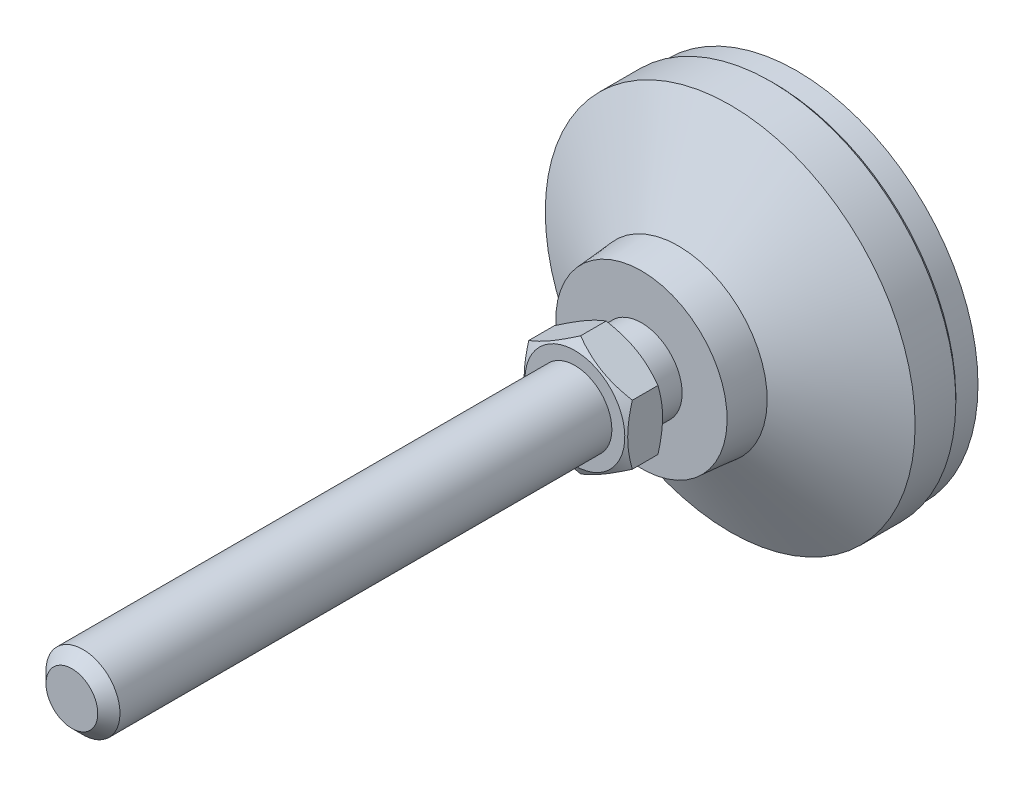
ISO-10303-21;
HEADER;
FILE_DESCRIPTION(('STEP AP214'),'2;1');
FILE_NAME('part.step','',(''),(''),'','','');
FILE_SCHEMA(('AUTOMOTIVE_DESIGN { 1 0 10303 214 1 1 1 1 }'));
ENDSEC;
DATA;
#1=APPLICATION_CONTEXT('core data for automotive mechanical design processes');
#2=APPLICATION_PROTOCOL_DEFINITION('international standard','automotive_design',2000,#1);
#3=PRODUCT_CONTEXT('',#1,'mechanical');
#4=PRODUCT('Part','Part','',(#3));
#5=PRODUCT_RELATED_PRODUCT_CATEGORY('part','',(#4));
#6=PRODUCT_DEFINITION_FORMATION('','',#4);
#7=PRODUCT_DEFINITION_CONTEXT('part definition',#1,'design');
#8=PRODUCT_DEFINITION('design','',#6,#7);
#9=PRODUCT_DEFINITION_SHAPE('','',#8);
#10=(LENGTH_UNIT() NAMED_UNIT(*) SI_UNIT(.MILLI.,.METRE.));
#11=(NAMED_UNIT(*) PLANE_ANGLE_UNIT() SI_UNIT($,.RADIAN.));
#12=(NAMED_UNIT(*) SI_UNIT($,.STERADIAN.) SOLID_ANGLE_UNIT());
#13=UNCERTAINTY_MEASURE_WITH_UNIT(LENGTH_MEASURE(1.E-05),#10,'distance_accuracy_value','');
#14=(GEOMETRIC_REPRESENTATION_CONTEXT(3) GLOBAL_UNCERTAINTY_ASSIGNED_CONTEXT((#13)) GLOBAL_UNIT_ASSIGNED_CONTEXT((#10,
#11,#12)) REPRESENTATION_CONTEXT('',''));
#15=CARTESIAN_POINT('',(0.,0.,0.));
#16=DIRECTION('',(0.,0.,1.));
#17=DIRECTION('',(1.,0.,0.));
#18=AXIS2_PLACEMENT_3D('',#15,#16,#17);
#19=CARTESIAN_POINT('',(0.,0.,2.));
#20=DIRECTION('',(0.,0.,-1.));
#21=DIRECTION('',(0.,1.,0.));
#22=AXIS2_PLACEMENT_3D('',#19,#20,#21);
#23=CYLINDRICAL_SURFACE('',#22,5.50000000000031);
#24=CARTESIAN_POINT('',(0.,0.,25.));
#25=DIRECTION('',(0.,0.,-1.));
#26=DIRECTION('',(0.,1.,0.));
#27=AXIS2_PLACEMENT_3D('',#24,#25,#26);
#28=CIRCLE('',#27,5.50000000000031);
#29=CARTESIAN_POINT('',(0.,5.50000000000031,25.));
#30=VERTEX_POINT('',#29);
#31=EDGE_CURVE('E100',#30,#30,#28,.T.);
#32=ORIENTED_EDGE('',*,*,#31,.T.);
#33=EDGE_LOOP('',(#32));
#34=FACE_BOUND('',#33,.T.);
#35=CARTESIAN_POINT('',(0.,0.,21.));
#36=DIRECTION('',(0.,0.,-1.));
#37=DIRECTION('',(0.,1.,0.));
#38=AXIS2_PLACEMENT_3D('',#35,#36,#37);
#39=CIRCLE('',#38,5.50000000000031);
#40=CARTESIAN_POINT('',(0.,5.50000000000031,21.));
#41=VERTEX_POINT('',#40);
#42=EDGE_CURVE('E93',#41,#41,#39,.T.);
#43=ORIENTED_EDGE('',*,*,#42,.F.);
#44=EDGE_LOOP('',(#43));
#45=FACE_BOUND('',#44,.T.);
#46=ADVANCED_FACE('F14',(#34,#45),#23,.T.);
#47=CARTESIAN_POINT('',(-5.50000000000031,0.,25.));
#48=DIRECTION('',(0.,0.,1.));
#49=DIRECTION('',(0.,-1.,0.));
#50=AXIS2_PLACEMENT_3D('',#47,#48,#49);
#51=PLANE('',#50);
#52=CARTESIAN_POINT('',(0.,0.,25.));
#53=DIRECTION('',(0.,0.,1.));
#54=DIRECTION('',(0.,-1.,0.));
#55=AXIS2_PLACEMENT_3D('',#52,#53,#54);
#56=CIRCLE('',#55,6.75);
#57=CARTESIAN_POINT('',(0.,-6.75,25.));
#58=VERTEX_POINT('',#57);
#59=EDGE_CURVE('E284',#58,#58,#56,.T.);
#60=ORIENTED_EDGE('',*,*,#59,.F.);
#61=EDGE_LOOP('',(#60));
#62=FACE_BOUND('',#61,.T.);
#63=ORIENTED_EDGE('',*,*,#31,.F.);
#64=EDGE_LOOP('',(#63));
#65=FACE_BOUND('',#64,.T.);
#66=ADVANCED_FACE('F142',(#62,#65),#51,.F.);
#67=CARTESIAN_POINT('',(0.,5.50000000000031,21.));
#68=DIRECTION('',(0.,0.,-1.));
#69=DIRECTION('',(0.,1.,0.));
#70=AXIS2_PLACEMENT_3D('',#67,#68,#69);
#71=PLANE('',#70);
#72=ORIENTED_EDGE('',*,*,#42,.T.);
#73=EDGE_LOOP('',(#72));
#74=FACE_BOUND('',#73,.T.);
#75=CARTESIAN_POINT('',(0.,0.,21.));
#76=DIRECTION('',(0.,0.,-1.));
#77=DIRECTION('',(0.,1.,0.));
#78=AXIS2_PLACEMENT_3D('',#75,#76,#77);
#79=CIRCLE('',#78,11.5833333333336);
#80=CARTESIAN_POINT('',(0.,11.5833333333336,21.));
#81=VERTEX_POINT('',#80);
#82=EDGE_CURVE('E88',#81,#81,#79,.T.);
#83=ORIENTED_EDGE('',*,*,#82,.F.);
#84=EDGE_LOOP('',(#83));
#85=FACE_BOUND('',#84,.T.);
#86=ADVANCED_FACE('F125',(#74,#85),#71,.F.);
#87=CARTESIAN_POINT('',(0.,0.,2.));
#88=DIRECTION('',(0.,0.,-1.));
#89=DIRECTION('',(0.,1.,0.));
#90=AXIS2_PLACEMENT_3D('',#87,#88,#89);
#91=CYLINDRICAL_SURFACE('',#90,25.);
#92=CARTESIAN_POINT('',(0.,0.,3.5));
#93=DIRECTION('',(0.,0.,1.));
#94=DIRECTION('',(0.,-1.,0.));
#95=AXIS2_PLACEMENT_3D('',#92,#93,#94);
#96=CIRCLE('',#95,25.);
#97=CARTESIAN_POINT('',(0.,-25.,3.5));
#98=VERTEX_POINT('',#97);
#99=EDGE_CURVE('E108',#98,#98,#96,.T.);
#100=ORIENTED_EDGE('',*,*,#99,.T.);
#101=EDGE_LOOP('',(#100));
#102=FACE_BOUND('',#101,.T.);
#103=CARTESIAN_POINT('',(0.,0.,9.));
#104=DIRECTION('',(0.,0.,-1.));
#105=DIRECTION('',(0.,1.,0.));
#106=AXIS2_PLACEMENT_3D('',#103,#104,#105);
#107=CIRCLE('',#106,25.);
#108=CARTESIAN_POINT('',(0.,25.,9.));
#109=VERTEX_POINT('',#108);
#110=EDGE_CURVE('E106',#109,#109,#107,.T.);
#111=ORIENTED_EDGE('',*,*,#110,.T.);
#112=EDGE_LOOP('',(#111));
#113=FACE_BOUND('',#112,.T.);
#114=ADVANCED_FACE('F121',(#102,#113),#91,.T.);
#115=CARTESIAN_POINT('',(0.,0.,16.));
#116=DIRECTION('',(0.,0.,-1.));
#117=DIRECTION('',(0.,1.,0.));
#118=AXIS2_PLACEMENT_3D('',#115,#116,#117);
#119=CONICAL_SURFACE('',#118,12.0000000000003,1.07685495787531);
#120=ORIENTED_EDGE('',*,*,#110,.F.);
#121=EDGE_LOOP('',(#120));
#122=FACE_BOUND('',#121,.T.);
#123=CARTESIAN_POINT('',(0.,0.,16.));
#124=DIRECTION('',(0.,0.,-1.));
#125=DIRECTION('',(0.,1.,0.));
#126=AXIS2_PLACEMENT_3D('',#123,#124,#125);
#127=CIRCLE('',#126,12.0000000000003);
#128=CARTESIAN_POINT('',(0.,12.0000000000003,16.));
#129=VERTEX_POINT('',#128);
#130=EDGE_CURVE('E103',#129,#129,#127,.T.);
#131=ORIENTED_EDGE('',*,*,#130,.T.);
#132=EDGE_LOOP('',(#131));
#133=FACE_BOUND('',#132,.T.);
#134=ADVANCED_FACE('F124',(#122,#133),#119,.T.);
#135=CARTESIAN_POINT('',(0.,0.,22.));
#136=DIRECTION('',(0.,0.,-1.));
#137=DIRECTION('',(0.,1.,0.));
#138=AXIS2_PLACEMENT_3D('',#135,#136,#137);
#139=CONICAL_SURFACE('',#138,11.5000000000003,0.0831412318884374);
#140=ORIENTED_EDGE('',*,*,#82,.T.);
#141=EDGE_LOOP('',(#140));
#142=FACE_BOUND('',#141,.T.);
#143=ORIENTED_EDGE('',*,*,#130,.F.);
#144=EDGE_LOOP('',(#143));
#145=FACE_BOUND('',#144,.T.);
#146=ADVANCED_FACE('F118',(#142,#145),#139,.T.);
#147=CARTESIAN_POINT('',(0.,0.,3.5));
#148=DIRECTION('',(0.,0.,1.));
#149=DIRECTION('',(0.,-1.,0.));
#150=AXIS2_PLACEMENT_3D('',#147,#148,#149);
#151=CONICAL_SURFACE('',#150,25.,0.785398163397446);
#152=CARTESIAN_POINT('',(0.,0.,3.));
#153=DIRECTION('',(0.,0.,1.));
#154=DIRECTION('',(0.,-1.,0.));
#155=AXIS2_PLACEMENT_3D('',#152,#153,#154);
#156=CIRCLE('',#155,24.5);
#157=CARTESIAN_POINT('',(0.,-24.5,3.));
#158=VERTEX_POINT('',#157);
#159=EDGE_CURVE('E28',#158,#158,#156,.F.);
#160=ORIENTED_EDGE('',*,*,#159,.F.);
#161=EDGE_LOOP('',(#160));
#162=FACE_BOUND('',#161,.T.);
#163=ORIENTED_EDGE('',*,*,#99,.F.);
#164=EDGE_LOOP('',(#163));
#165=FACE_BOUND('',#164,.T.);
#166=ADVANCED_FACE('F16',(#162,#165),#151,.T.);
#167=CARTESIAN_POINT('',(0.,0.,0.));
#168=DIRECTION('',(0.,0.,1.));
#169=DIRECTION('',(0.,-1.,0.));
#170=AXIS2_PLACEMENT_3D('',#167,#168,#169);
#171=CYLINDRICAL_SURFACE('',#170,24.5);
#172=CARTESIAN_POINT('',(0.,0.,0.));
#173=DIRECTION('',(0.,0.,-1.));
#174=DIRECTION('',(0.,1.,0.));
#175=AXIS2_PLACEMENT_3D('',#172,#173,#174);
#176=CIRCLE('',#175,24.5);
#177=CARTESIAN_POINT('',(0.,24.5,0.));
#178=VERTEX_POINT('',#177);
#179=EDGE_CURVE('E251',#178,#178,#176,.T.);
#180=ORIENTED_EDGE('',*,*,#179,.F.);
#181=EDGE_LOOP('',(#180));
#182=FACE_BOUND('',#181,.T.);
#183=ORIENTED_EDGE('',*,*,#159,.T.);
#184=EDGE_LOOP('',(#183));
#185=FACE_BOUND('',#184,.T.);
#186=ADVANCED_FACE('F114',(#182,#185),#171,.T.);
#187=CARTESIAN_POINT('',(0.,0.,0.));
#188=DIRECTION('',(0.,0.,-1.));
#189=DIRECTION('',(0.,1.,0.));
#190=AXIS2_PLACEMENT_3D('',#187,#188,#189);
#191=PLANE('',#190);
#192=ORIENTED_EDGE('',*,*,#179,.T.);
#193=EDGE_LOOP('',(#192));
#194=FACE_BOUND('',#193,.T.);
#195=ADVANCED_FACE('F193',(#194),#191,.T.);
#196=CARTESIAN_POINT('',(0.,0.,25.));
#197=DIRECTION('',(0.,0.,1.));
#198=DIRECTION('',(0.,-1.,0.));
#199=AXIS2_PLACEMENT_3D('',#196,#197,#198);
#200=CONICAL_SURFACE('',#199,6.75,1.0471975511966);
#201=CARTESIAN_POINT('',(0.000200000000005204,-8.08301923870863,25.7696190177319));
#202=CARTESIAN_POINT('',(-0.15366790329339,-7.99418356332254,25.7183374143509));
#203=CARTESIAN_POINT('',(-0.30810950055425,-7.90501666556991,25.669383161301));
#204=CARTESIAN_POINT('',(-0.618246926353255,-7.72595873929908,25.5767703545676));
#205=CARTESIAN_POINT('',(-0.773943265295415,-7.63606741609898,25.5331140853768));
#206=CARTESIAN_POINT('',(-1.24352516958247,-7.36495417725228,25.4109491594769));
#207=CARTESIAN_POINT('',(-1.5592643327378,-7.18266208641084,25.3414631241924));
#208=CARTESIAN_POINT('',(-2.03176224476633,-6.90986528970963,25.2599825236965));
#209=CARTESIAN_POINT('',(-2.18710922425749,-6.82017566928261,25.2367710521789));
#210=CARTESIAN_POINT('',(-2.49850511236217,-6.64039116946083,25.1978487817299));
#211=CARTESIAN_POINT('',(-2.65455395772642,-6.55029632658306,25.1821373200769));
#212=CARTESIAN_POINT('',(-2.96692267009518,-6.36995016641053,25.1586154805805));
#213=CARTESIAN_POINT('',(-3.12324202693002,-6.27969914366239,25.1507961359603));
#214=CARTESIAN_POINT('',(-3.43601650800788,-6.09911871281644,25.1432178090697));
#215=CARTESIAN_POINT('',(-3.59247162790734,-6.00878930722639,25.1434585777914));
#216=CARTESIAN_POINT('',(-4.02110687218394,-5.76131663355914,25.155197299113));
#217=CARTESIAN_POINT('',(-4.2931466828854,-5.60425437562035,25.1749033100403));
#218=CARTESIAN_POINT('',(-4.8354194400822,-5.29117305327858,25.2373910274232));
#219=CARTESIAN_POINT('',(-5.10565047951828,-5.13515508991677,25.2801940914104));
#220=CARTESIAN_POINT('',(-5.64901454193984,-4.82144370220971,25.3871892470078));
#221=CARTESIAN_POINT('',(-5.92207900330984,-4.66378986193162,25.4518346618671));
#222=CARTESIAN_POINT('',(-6.46413578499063,-4.35083323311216,25.5985536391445));
#223=CARTESIAN_POINT('',(-6.73313504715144,-4.1955264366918,25.680592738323));
#224=CARTESIAN_POINT('',(-7.0002,-4.04133641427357,25.7696190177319));
#225=B_SPLINE_CURVE_WITH_KNOTS('',3,(#201,#202,#203,#204,#205,#206,#207,#208,#209,#210,#211,
#212,#213,#214,#215,#216,#217,#218,#219,#220,#221,#222,#223,#224),.UNSPECIFIED.,.F.,.F.,(4,2,2,
2,2,2,2,2,2,2,2,4),(0.,0.554727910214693,1.10969417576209,2.2219327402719,2.76443041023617,
3.30688013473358,3.84871284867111,4.3905288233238,5.33376515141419,6.27787517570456,
7.2429241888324,8.20607866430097),.UNSPECIFIED.);
#226=CARTESIAN_POINT('',(0.,-8.08290376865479,25.7695523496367));
#227=VERTEX_POINT('',#226);
#228=CARTESIAN_POINT('',(-7.,-4.04145188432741,25.7695523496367));
#229=VERTEX_POINT('',#228);
#230=EDGE_CURVE('E73',#227,#229,#225,.T.);
#231=ORIENTED_EDGE('',*,*,#230,.T.);
#232=CARTESIAN_POINT('',(-7.,10.8837636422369,28.5740817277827));
#233=CARTESIAN_POINT('',(-7.,10.5777915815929,28.4255457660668));
#234=CARTESIAN_POINT('',(-7.,10.2711201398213,28.2784259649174));
#235=CARTESIAN_POINT('',(-7.,9.65600665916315,27.9878146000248));
#236=CARTESIAN_POINT('',(-7.,9.34756435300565,27.8443236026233));
#237=CARTESIAN_POINT('',(-7.,8.72696150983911,27.5610498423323));
#238=CARTESIAN_POINT('',(-7.,8.41478988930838,27.4212912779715));
#239=CARTESIAN_POINT('',(-7.,7.78797355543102,27.1474563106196));
#240=CARTESIAN_POINT('',(-7.,7.47332895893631,27.0133796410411));
#241=CARTESIAN_POINT('',(-7.,6.83080388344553,26.7481718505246));
#242=CARTESIAN_POINT('',(-7.,6.50282517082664,26.6172774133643));
#243=CARTESIAN_POINT('',(-7.,5.84304174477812,26.3653275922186));
#244=CARTESIAN_POINT('',(-7.,5.51123660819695,26.2442733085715));
#245=CARTESIAN_POINT('',(-7.,4.8438804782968,26.0151615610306));
#246=CARTESIAN_POINT('',(-7.,4.50833853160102,25.9070780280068));
#247=CARTESIAN_POINT('',(-7.,3.83245340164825,25.7073561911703));
#248=CARTESIAN_POINT('',(-7.,3.49211175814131,25.6157127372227));
#249=CARTESIAN_POINT('',(-7.,2.80827179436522,25.4537453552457));
#250=CARTESIAN_POINT('',(-7.,2.46480185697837,25.3833048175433));
#251=CARTESIAN_POINT('',(-7.,1.94644652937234,25.2965814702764));
#252=CARTESIAN_POINT('',(-7.,1.77312364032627,25.2708287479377));
#253=CARTESIAN_POINT('',(-7.,1.42560767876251,25.2261404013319));
#254=CARTESIAN_POINT('',(-7.,1.25141469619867,25.2072040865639));
#255=CARTESIAN_POINT('',(-7.,0.904678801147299,25.1767645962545));
#256=CARTESIAN_POINT('',(-7.,0.732144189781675,25.1651672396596));
#257=CARTESIAN_POINT('',(-7.,0.386739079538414,25.1492805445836));
#258=CARTESIAN_POINT('',(-7.,0.213868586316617,25.144991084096));
#259=CARTESIAN_POINT('',(-7.,-0.131899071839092,25.1438225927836));
#260=CARTESIAN_POINT('',(-7.,-0.304796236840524,25.1469435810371));
#261=CARTESIAN_POINT('',(-7.,-0.650304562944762,25.1605193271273));
#262=CARTESIAN_POINT('',(-7.,-0.822915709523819,25.1709744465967));
#263=CARTESIAN_POINT('',(-7.,-1.23690300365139,25.2046230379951));
#264=CARTESIAN_POINT('',(-7.,-1.47800611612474,25.2312490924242));
#265=CARTESIAN_POINT('',(-7.,-1.9584299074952,25.2973641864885));
#266=CARTESIAN_POINT('',(-7.,-2.19775034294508,25.3368549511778));
#267=CARTESIAN_POINT('',(-7.,-2.91275984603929,25.4725309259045));
#268=CARTESIAN_POINT('',(-7.,-3.38523259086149,25.5858954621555));
#269=CARTESIAN_POINT('',(-7.,-4.0917486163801,25.782576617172));
#270=CARTESIAN_POINT('',(-7.,-4.32945384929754,25.8534962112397));
#271=CARTESIAN_POINT('',(-7.,-4.80255577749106,26.0027259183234));
#272=CARTESIAN_POINT('',(-7.,-5.03795245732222,26.0810360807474));
#273=CARTESIAN_POINT('',(-7.,-5.5065109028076,26.2437883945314));
#274=CARTESIAN_POINT('',(-7.,-5.7396733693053,26.3282285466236));
#275=CARTESIAN_POINT('',(-7.,-6.20406472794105,26.5022448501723));
#276=CARTESIAN_POINT('',(-7.,-6.43529364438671,26.5918209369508));
#277=CARTESIAN_POINT('',(-7.,-6.98752912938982,26.8116843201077));
#278=CARTESIAN_POINT('',(-7.,-7.30772186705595,26.9440121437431));
#279=CARTESIAN_POINT('',(-7.,-7.94532947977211,27.2152186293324));
#280=CARTESIAN_POINT('',(-7.,-8.26274417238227,27.3540977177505));
#281=CARTESIAN_POINT('',(-7.,-8.89532383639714,27.6370728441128));
#282=CARTESIAN_POINT('',(-7.,-9.21048825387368,27.781170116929));
#283=CARTESIAN_POINT('',(-7.,-9.83887440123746,28.0735110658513));
#284=CARTESIAN_POINT('',(-7.,-10.1520961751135,28.2217546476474));
#285=CARTESIAN_POINT('',(-7.,-10.7772822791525,28.5217708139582));
#286=CARTESIAN_POINT('',(-7.,-11.0892447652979,28.6735472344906));
#287=CARTESIAN_POINT('',(-7.,-11.7118136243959,28.9798589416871));
#288=CARTESIAN_POINT('',(-7.,-12.0224199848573,29.1343942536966));
#289=CARTESIAN_POINT('',(-7.,-12.9524461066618,29.60135042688));
#290=CARTESIAN_POINT('',(-7.,-13.5701618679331,29.9171645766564));
#291=CARTESIAN_POINT('',(-7.,-14.7493863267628,30.5277239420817));
#292=CARTESIAN_POINT('',(-7.,-15.3111656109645,30.8219489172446));
#293=CARTESIAN_POINT('',(-7.,-16.4326469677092,31.4143794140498));
#294=CARTESIAN_POINT('',(-7.,-16.9923489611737,31.7125850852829));
#295=CARTESIAN_POINT('',(-7.,-18.1086887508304,32.3112433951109));
#296=CARTESIAN_POINT('',(-7.,-18.6653307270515,32.6116882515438));
#297=CARTESIAN_POINT('',(-7.,-19.7772906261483,33.2149435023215));
#298=CARTESIAN_POINT('',(-7.,-20.3326086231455,33.5177537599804));
#299=CARTESIAN_POINT('',(-7.,-20.8874414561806,33.8214444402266));
#300=B_SPLINE_CURVE_WITH_KNOTS('',3,(#232,#233,#234,#235,#236,#237,#238,#239,#240,#241,#242,
#243,#244,#245,#246,#247,#248,#249,#250,#251,#252,#253,#254,#255,#256,#257,#258,#259,#260,#261,
#262,#263,#264,#265,#266,#267,#268,#269,#270,#271,#272,#273,#274,#275,#276,#277,#278,#279,#280,
#281,#282,#283,#284,#285,#286,#287,#288,#289,#290,#291,#292,#293,#294,#295,#296,#297,#298,#299),
.UNSPECIFIED.,.F.,.F.,(4,2,2,2,2,2,2,2,2,2,2,2,2,2,2,2,2,2,2,2,2,2,2,2,2,2,2,2,2,2,2,2,2,4),(0.,
1.02037328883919,2.04090485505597,3.0669453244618,4.09293759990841,5.15221607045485,
6.21161282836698,7.26884338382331,8.32574216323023,9.37671739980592,9.90228140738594,
10.427792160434,10.9464144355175,11.4650280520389,11.9836430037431,12.5022835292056,
13.2295797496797,13.9569735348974,15.412554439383,16.1566694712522,16.900789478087,
17.6446678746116,18.3885369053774,19.4278154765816,20.4671617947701,21.5067557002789,
22.5463259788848,23.5870831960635,24.6278499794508,26.7090870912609,28.6115629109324,
30.5141104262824,32.4117493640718,34.3092794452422),.UNSPECIFIED.);
#301=CARTESIAN_POINT('',(-7.,4.04145188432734,25.7695523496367));
#302=VERTEX_POINT('',#301);
#303=EDGE_CURVE('E81',#229,#302,#300,.F.);
#304=ORIENTED_EDGE('',*,*,#303,.T.);
#305=CARTESIAN_POINT('',(-7.0002,4.0413364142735,25.7696190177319));
#306=CARTESIAN_POINT('',(-6.84633209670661,4.13017208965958,25.7183374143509));
#307=CARTESIAN_POINT('',(-6.69189049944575,4.21933898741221,25.669383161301));
#308=CARTESIAN_POINT('',(-6.38175307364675,4.39839691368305,25.5767703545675));
#309=CARTESIAN_POINT('',(-6.22605673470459,4.48828823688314,25.5331140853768));
#310=CARTESIAN_POINT('',(-5.75647483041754,4.75940147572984,25.4109491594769));
#311=CARTESIAN_POINT('',(-5.44073566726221,4.94169356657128,25.3414631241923));
#312=CARTESIAN_POINT('',(-4.96823775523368,5.21449036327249,25.2599825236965));
#313=CARTESIAN_POINT('',(-4.81289077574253,5.3041799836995,25.2367710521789));
#314=CARTESIAN_POINT('',(-4.50149488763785,5.48396448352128,25.1978487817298));
#315=CARTESIAN_POINT('',(-4.34544604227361,5.57405932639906,25.1821373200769));
#316=CARTESIAN_POINT('',(-4.03307732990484,5.75440548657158,25.1586154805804));
#317=CARTESIAN_POINT('',(-3.87675797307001,5.84465650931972,25.1507961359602));
#318=CARTESIAN_POINT('',(-3.56398349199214,6.02523694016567,25.1432178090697));
#319=CARTESIAN_POINT('',(-3.40752837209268,6.11556634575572,25.1434585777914));
#320=CARTESIAN_POINT('',(-2.97889312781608,6.36303901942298,25.155197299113));
#321=CARTESIAN_POINT('',(-2.70685331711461,6.52010127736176,25.1749033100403));
#322=CARTESIAN_POINT('',(-2.16458055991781,6.83318259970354,25.2373910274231));
#323=CARTESIAN_POINT('',(-1.89434952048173,6.98920056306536,25.2801940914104));
#324=CARTESIAN_POINT('',(-1.35098545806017,7.30291195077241,25.3871892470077));
#325=CARTESIAN_POINT('',(-1.07792099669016,7.4605657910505,25.451834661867));
#326=CARTESIAN_POINT('',(-0.535864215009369,7.77352241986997,25.5985536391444));
#327=CARTESIAN_POINT('',(-0.266864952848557,7.92882921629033,25.680592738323));
#328=CARTESIAN_POINT('',(0.000200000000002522,8.08301923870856,25.7696190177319));
#329=B_SPLINE_CURVE_WITH_KNOTS('',3,(#305,#306,#307,#308,#309,#310,#311,#312,#313,#314,#315,
#316,#317,#318,#319,#320,#321,#322,#323,#324,#325,#326,#327,#328),.UNSPECIFIED.,.F.,.F.,(4,2,2,
2,2,2,2,2,2,2,2,4),(0.,0.554727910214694,1.10969417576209,2.22193274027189,2.76443041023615,
3.30688013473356,3.84871284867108,4.39052882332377,5.33376515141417,6.27787517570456,
7.2429241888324,8.20607866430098),.UNSPECIFIED.);
#330=CARTESIAN_POINT('',(0.,8.08290376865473,25.7695523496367));
#331=VERTEX_POINT('',#330);
#332=EDGE_CURVE('E214',#302,#331,#329,.T.);
#333=ORIENTED_EDGE('',*,*,#332,.T.);
#334=CARTESIAN_POINT('',(-0.000199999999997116,8.08301923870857,25.7696190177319));
#335=CARTESIAN_POINT('',(0.153667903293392,7.99418356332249,25.7183374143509));
#336=CARTESIAN_POINT('',(0.308109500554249,7.90501666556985,25.669383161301));
#337=CARTESIAN_POINT('',(0.618246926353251,7.72595873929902,25.5767703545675));
#338=CARTESIAN_POINT('',(0.773943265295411,7.63606741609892,25.5331140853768));
#339=CARTESIAN_POINT('',(1.24352516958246,7.36495417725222,25.4109491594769));
#340=CARTESIAN_POINT('',(1.55926433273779,7.18266208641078,25.3414631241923));
#341=CARTESIAN_POINT('',(2.03176224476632,6.90986528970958,25.2599825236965));
#342=CARTESIAN_POINT('',(2.18710922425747,6.82017566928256,25.2367710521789));
#343=CARTESIAN_POINT('',(2.49850511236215,6.64039116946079,25.1978487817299));
#344=CARTESIAN_POINT('',(2.65455395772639,6.55029632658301,25.1821373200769));
#345=CARTESIAN_POINT('',(2.96692267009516,6.36995016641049,25.1586154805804));
#346=CARTESIAN_POINT('',(3.12324202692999,6.27969914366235,25.1507961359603));
#347=CARTESIAN_POINT('',(3.43601650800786,6.0991187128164,25.1432178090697));
#348=CARTESIAN_POINT('',(3.59247162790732,6.00878930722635,25.1434585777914));
#349=CARTESIAN_POINT('',(4.02110687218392,5.76131663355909,25.155197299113));
#350=CARTESIAN_POINT('',(4.29314668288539,5.60425437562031,25.1749033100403));
#351=CARTESIAN_POINT('',(4.83541944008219,5.29117305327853,25.2373910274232));
#352=CARTESIAN_POINT('',(5.10565047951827,5.13515508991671,25.2801940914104));
#353=CARTESIAN_POINT('',(5.64901454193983,4.82144370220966,25.3871892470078));
#354=CARTESIAN_POINT('',(5.92207900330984,4.66378986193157,25.4518346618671));
#355=CARTESIAN_POINT('',(6.46413578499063,4.3508332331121,25.5985536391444));
#356=CARTESIAN_POINT('',(6.73313504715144,4.19552643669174,25.680592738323));
#357=CARTESIAN_POINT('',(7.0002,4.04133641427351,25.7696190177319));
#358=B_SPLINE_CURVE_WITH_KNOTS('',3,(#334,#335,#336,#337,#338,#339,#340,#341,#342,#343,#344,
#345,#346,#347,#348,#349,#350,#351,#352,#353,#354,#355,#356,#357),.UNSPECIFIED.,.F.,.F.,(4,2,2,
2,2,2,2,2,2,2,2,4),(0.,0.554727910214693,1.10969417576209,2.22193274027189,2.76443041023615,
3.30688013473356,3.84871284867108,4.39052882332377,5.33376515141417,6.27787517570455,
7.2429241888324,8.20607866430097),.UNSPECIFIED.);
#359=CARTESIAN_POINT('',(7.,4.04145188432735,25.7695523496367));
#360=VERTEX_POINT('',#359);
#361=EDGE_CURVE('E208',#331,#360,#358,.T.);
#362=ORIENTED_EDGE('',*,*,#361,.T.);
#363=CARTESIAN_POINT('',(7.,10.8837636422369,28.5740817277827));
#364=CARTESIAN_POINT('',(7.,10.5777915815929,28.4255457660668));
#365=CARTESIAN_POINT('',(7.,10.2711201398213,28.2784259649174));
#366=CARTESIAN_POINT('',(7.,9.65600665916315,27.9878146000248));
#367=CARTESIAN_POINT('',(7.,9.34756435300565,27.8443236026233));
#368=CARTESIAN_POINT('',(7.,8.72696150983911,27.5610498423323));
#369=CARTESIAN_POINT('',(7.,8.41478988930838,27.4212912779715));
#370=CARTESIAN_POINT('',(7.,7.78797355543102,27.1474563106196));
#371=CARTESIAN_POINT('',(7.,7.47332895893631,27.0133796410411));
#372=CARTESIAN_POINT('',(7.,6.83080388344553,26.7481718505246));
#373=CARTESIAN_POINT('',(7.,6.50282517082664,26.6172774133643));
#374=CARTESIAN_POINT('',(7.,5.84304174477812,26.3653275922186));
#375=CARTESIAN_POINT('',(7.,5.51123660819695,26.2442733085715));
#376=CARTESIAN_POINT('',(7.,4.84388047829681,26.0151615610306));
#377=CARTESIAN_POINT('',(7.,4.50833853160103,25.9070780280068));
#378=CARTESIAN_POINT('',(7.,3.83245340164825,25.7073561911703));
#379=CARTESIAN_POINT('',(7.,3.49211175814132,25.6157127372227));
#380=CARTESIAN_POINT('',(7.,2.80827179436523,25.4537453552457));
#381=CARTESIAN_POINT('',(7.,2.46480185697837,25.3833048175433));
#382=CARTESIAN_POINT('',(7.,1.94644652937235,25.2965814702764));
#383=CARTESIAN_POINT('',(7.,1.77312364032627,25.2708287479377));
#384=CARTESIAN_POINT('',(7.,1.42560767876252,25.2261404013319));
#385=CARTESIAN_POINT('',(7.,1.25141469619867,25.2072040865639));
#386=CARTESIAN_POINT('',(7.,0.904678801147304,25.1767645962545));
#387=CARTESIAN_POINT('',(7.,0.732144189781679,25.1651672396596));
#388=CARTESIAN_POINT('',(7.,0.386739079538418,25.1492805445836));
#389=CARTESIAN_POINT('',(7.,0.213868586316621,25.144991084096));
#390=CARTESIAN_POINT('',(7.,-0.131899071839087,25.1438225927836));
#391=CARTESIAN_POINT('',(7.,-0.30479623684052,25.1469435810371));
#392=CARTESIAN_POINT('',(7.,-0.650304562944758,25.1605193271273));
#393=CARTESIAN_POINT('',(7.,-0.822915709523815,25.1709744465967));
#394=CARTESIAN_POINT('',(7.,-1.23690300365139,25.2046230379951));
#395=CARTESIAN_POINT('',(7.,-1.47800611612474,25.2312490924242));
#396=CARTESIAN_POINT('',(7.,-1.95842990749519,25.2973641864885));
#397=CARTESIAN_POINT('',(7.,-2.19775034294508,25.3368549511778));
#398=CARTESIAN_POINT('',(7.,-2.91275984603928,25.4725309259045));
#399=CARTESIAN_POINT('',(7.,-3.38523259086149,25.5858954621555));
#400=CARTESIAN_POINT('',(7.,-4.0917486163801,25.782576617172));
#401=CARTESIAN_POINT('',(7.,-4.32945384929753,25.8534962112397));
#402=CARTESIAN_POINT('',(7.,-4.80255577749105,26.0027259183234));
#403=CARTESIAN_POINT('',(7.,-5.03795245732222,26.0810360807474));
#404=CARTESIAN_POINT('',(7.,-5.5065109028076,26.2437883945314));
#405=CARTESIAN_POINT('',(7.,-5.73967336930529,26.3282285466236));
#406=CARTESIAN_POINT('',(7.,-6.20406472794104,26.5022448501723));
#407=CARTESIAN_POINT('',(7.,-6.4352936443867,26.5918209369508));
#408=CARTESIAN_POINT('',(7.,-6.98752912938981,26.8116843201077));
#409=CARTESIAN_POINT('',(7.,-7.30772186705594,26.9440121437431));
#410=CARTESIAN_POINT('',(7.,-7.9453294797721,27.2152186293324));
#411=CARTESIAN_POINT('',(7.,-8.26274417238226,27.3540977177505));
#412=CARTESIAN_POINT('',(7.,-8.89532383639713,27.6370728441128));
#413=CARTESIAN_POINT('',(7.,-9.21048825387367,27.781170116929));
#414=CARTESIAN_POINT('',(7.,-9.83887440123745,28.0735110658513));
#415=CARTESIAN_POINT('',(7.,-10.1520961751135,28.2217546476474));
#416=CARTESIAN_POINT('',(7.,-10.7772822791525,28.5217708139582));
#417=CARTESIAN_POINT('',(7.,-11.0892447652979,28.6735472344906));
#418=CARTESIAN_POINT('',(7.,-11.7118136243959,28.9798589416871));
#419=CARTESIAN_POINT('',(7.,-12.0224199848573,29.1343942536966));
#420=CARTESIAN_POINT('',(7.,-12.9524461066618,29.60135042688));
#421=CARTESIAN_POINT('',(7.,-13.5701618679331,29.9171645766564));
#422=CARTESIAN_POINT('',(7.,-14.7493863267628,30.5277239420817));
#423=CARTESIAN_POINT('',(7.,-15.3111656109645,30.8219489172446));
#424=CARTESIAN_POINT('',(7.,-16.4326469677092,31.4143794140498));
#425=CARTESIAN_POINT('',(7.,-16.9923489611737,31.7125850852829));
#426=CARTESIAN_POINT('',(7.,-18.1086887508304,32.3112433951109));
#427=CARTESIAN_POINT('',(7.,-18.6653307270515,32.6116882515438));
#428=CARTESIAN_POINT('',(7.,-19.7772906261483,33.2149435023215));
#429=CARTESIAN_POINT('',(7.,-20.3326086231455,33.5177537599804));
#430=CARTESIAN_POINT('',(7.,-20.8874414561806,33.8214444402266));
#431=B_SPLINE_CURVE_WITH_KNOTS('',3,(#363,#364,#365,#366,#367,#368,#369,#370,#371,#372,#373,
#374,#375,#376,#377,#378,#379,#380,#381,#382,#383,#384,#385,#386,#387,#388,#389,#390,#391,#392,
#393,#394,#395,#396,#397,#398,#399,#400,#401,#402,#403,#404,#405,#406,#407,#408,#409,#410,#411,
#412,#413,#414,#415,#416,#417,#418,#419,#420,#421,#422,#423,#424,#425,#426,#427,#428,#429,#430),
.UNSPECIFIED.,.F.,.F.,(4,2,2,2,2,2,2,2,2,2,2,2,2,2,2,2,2,2,2,2,2,2,2,2,2,2,2,2,2,2,2,2,2,4),(0.,
1.02037328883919,2.04090485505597,3.0669453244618,4.09293759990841,5.15221607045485,
6.21161282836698,7.2688433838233,8.32574216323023,9.37671739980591,9.90228140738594,
10.4277921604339,10.9464144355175,11.4650280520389,11.9836430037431,12.5022835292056,
13.2295797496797,13.9569735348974,15.4125544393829,16.1566694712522,16.900789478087,
17.6446678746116,18.3885369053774,19.4278154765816,20.4671617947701,21.5067557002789,
22.5463259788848,23.5870831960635,24.6278499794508,26.7090870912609,28.6115629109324,
30.5141104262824,32.4117493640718,34.3092794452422),.UNSPECIFIED.);
#432=CARTESIAN_POINT('',(7.,-4.04145188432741,25.7695523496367));
#433=VERTEX_POINT('',#432);
#434=EDGE_CURVE('E34',#360,#433,#431,.T.);
#435=ORIENTED_EDGE('',*,*,#434,.T.);
#436=CARTESIAN_POINT('',(7.0002,-4.04133641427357,25.7696190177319));
#437=CARTESIAN_POINT('',(6.84633209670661,-4.13017208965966,25.7183374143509));
#438=CARTESIAN_POINT('',(6.69189049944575,-4.21933898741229,25.669383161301));
#439=CARTESIAN_POINT('',(6.38175307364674,-4.39839691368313,25.5767703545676));
#440=CARTESIAN_POINT('',(6.22605673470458,-4.48828823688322,25.5331140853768));
#441=CARTESIAN_POINT('',(5.75647483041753,-4.75940147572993,25.4109491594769));
#442=CARTESIAN_POINT('',(5.44073566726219,-4.94169356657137,25.3414631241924));
#443=CARTESIAN_POINT('',(4.96823775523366,-5.21449036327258,25.2599825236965));
#444=CARTESIAN_POINT('',(4.81289077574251,-5.30417998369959,25.2367710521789));
#445=CARTESIAN_POINT('',(4.50149488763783,-5.48396448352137,25.1978487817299));
#446=CARTESIAN_POINT('',(4.34544604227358,-5.57405932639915,25.1821373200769));
#447=CARTESIAN_POINT('',(4.03307732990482,-5.75440548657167,25.1586154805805));
#448=CARTESIAN_POINT('',(3.87675797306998,-5.84465650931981,25.1507961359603));
#449=CARTESIAN_POINT('',(3.56398349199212,-6.02523694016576,25.1432178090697));
#450=CARTESIAN_POINT('',(3.40752837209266,-6.11556634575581,25.1434585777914));
#451=CARTESIAN_POINT('',(2.97889312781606,-6.36303901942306,25.155197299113));
#452=CARTESIAN_POINT('',(2.7068533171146,-6.52010127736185,25.1749033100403));
#453=CARTESIAN_POINT('',(2.16458055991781,-6.83318259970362,25.2373910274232));
#454=CARTESIAN_POINT('',(1.89434952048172,-6.98920056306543,25.2801940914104));
#455=CARTESIAN_POINT('',(1.35098545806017,-7.30291195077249,25.3871892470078));
#456=CARTESIAN_POINT('',(1.07792099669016,-7.46056579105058,25.4518346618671));
#457=CARTESIAN_POINT('',(0.535864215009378,-7.77352241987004,25.5985536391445));
#458=CARTESIAN_POINT('',(0.266864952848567,-7.9288292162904,25.680592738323));
#459=CARTESIAN_POINT('',(-0.000199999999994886,-8.08301923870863,25.7696190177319));
#460=B_SPLINE_CURVE_WITH_KNOTS('',3,(#436,#437,#438,#439,#440,#441,#442,#443,#444,#445,#446,
#447,#448,#449,#450,#451,#452,#453,#454,#455,#456,#457,#458,#459),.UNSPECIFIED.,.F.,.F.,(4,2,2,
2,2,2,2,2,2,2,2,4),(0.,0.554727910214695,1.10969417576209,2.2219327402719,2.76443041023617,
3.30688013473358,3.8487128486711,4.39052882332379,5.33376515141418,6.27787517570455,
7.24292418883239,8.20607866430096),.UNSPECIFIED.);
#461=EDGE_CURVE('E9',#433,#227,#460,.T.);
#462=ORIENTED_EDGE('',*,*,#461,.T.);
#463=EDGE_LOOP('',(#231,#304,#333,#362,#435,#462));
#464=FACE_BOUND('',#463,.T.);
#465=ORIENTED_EDGE('',*,*,#59,.T.);
#466=EDGE_LOOP('',(#465));
#467=FACE_BOUND('',#466,.T.);
#468=ADVANCED_FACE('F71',(#464,#467),#200,.T.);
#469=CARTESIAN_POINT('',(0.,0.,98.));
#470=DIRECTION('',(0.,0.,-1.));
#471=DIRECTION('',(0.,1.,0.));
#472=AXIS2_PLACEMENT_3D('',#469,#470,#471);
#473=PLANE('',#472);
#474=CARTESIAN_POINT('',(0.,0.,98.));
#475=DIRECTION('',(0.,0.,-1.));
#476=DIRECTION('',(0.,1.,0.));
#477=AXIS2_PLACEMENT_3D('',#474,#475,#476);
#478=CIRCLE('',#477,3.50000000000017);
#479=CARTESIAN_POINT('',(0.,3.50000000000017,98.));
#480=VERTEX_POINT('',#479);
#481=EDGE_CURVE('E257',#480,#480,#478,.T.);
#482=ORIENTED_EDGE('',*,*,#481,.F.);
#483=EDGE_LOOP('',(#482));
#484=FACE_BOUND('',#483,.T.);
#485=ADVANCED_FACE('F192',(#484),#473,.F.);
#486=CARTESIAN_POINT('',(0.,0.,98.));
#487=DIRECTION('',(0.,0.,-1.));
#488=DIRECTION('',(0.,1.,0.));
#489=AXIS2_PLACEMENT_3D('',#486,#487,#488);
#490=CONICAL_SURFACE('',#489,3.50000000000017,0.785398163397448);
#491=CARTESIAN_POINT('',(0.,0.,96.5));
#492=DIRECTION('',(0.,0.,-1.));
#493=DIRECTION('',(0.,1.,0.));
#494=AXIS2_PLACEMENT_3D('',#491,#492,#493);
#495=CIRCLE('',#494,5.00000000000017);
#496=CARTESIAN_POINT('',(0.,5.00000000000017,96.5));
#497=VERTEX_POINT('',#496);
#498=EDGE_CURVE('E253',#497,#497,#495,.T.);
#499=ORIENTED_EDGE('',*,*,#498,.F.);
#500=EDGE_LOOP('',(#499));
#501=FACE_BOUND('',#500,.T.);
#502=ORIENTED_EDGE('',*,*,#481,.T.);
#503=EDGE_LOOP('',(#502));
#504=FACE_BOUND('',#503,.T.);
#505=ADVANCED_FACE('F160',(#501,#504),#490,.T.);
#506=CARTESIAN_POINT('',(0.,0.,2.));
#507=DIRECTION('',(0.,0.,-1.));
#508=DIRECTION('',(0.,1.,0.));
#509=AXIS2_PLACEMENT_3D('',#506,#507,#508);
#510=CYLINDRICAL_SURFACE('',#509,5.00000000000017);
#511=CARTESIAN_POINT('',(0.,0.,30.));
#512=DIRECTION('',(0.,0.,-1.));
#513=DIRECTION('',(0.,1.,0.));
#514=AXIS2_PLACEMENT_3D('',#511,#512,#513);
#515=CIRCLE('',#514,5.00000000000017);
#516=CARTESIAN_POINT('',(0.,5.00000000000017,30.));
#517=VERTEX_POINT('',#516);
#518=EDGE_CURVE('E97',#517,#517,#515,.T.);
#519=ORIENTED_EDGE('',*,*,#518,.F.);
#520=EDGE_LOOP('',(#519));
#521=FACE_BOUND('',#520,.T.);
#522=ORIENTED_EDGE('',*,*,#498,.T.);
#523=EDGE_LOOP('',(#522));
#524=FACE_BOUND('',#523,.T.);
#525=ADVANCED_FACE('F156',(#521,#524),#510,.T.);
#526=CARTESIAN_POINT('',(-5.00000000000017,0.,30.));
#527=DIRECTION('',(0.,0.,-1.));
#528=DIRECTION('',(0.,1.,0.));
#529=AXIS2_PLACEMENT_3D('',#526,#527,#528);
#530=PLANE('',#529);
#531=CARTESIAN_POINT('',(0.,0.,30.));
#532=DIRECTION('',(0.,0.,1.));
#533=DIRECTION('',(0.,-1.,0.));
#534=AXIS2_PLACEMENT_3D('',#531,#532,#533);
#535=CIRCLE('',#534,6.75);
#536=CARTESIAN_POINT('',(0.,-6.75,30.));
#537=VERTEX_POINT('',#536);
#538=EDGE_CURVE('E80',#537,#537,#535,.T.);
#539=ORIENTED_EDGE('',*,*,#538,.T.);
#540=EDGE_LOOP('',(#539));
#541=FACE_BOUND('',#540,.T.);
#542=ORIENTED_EDGE('',*,*,#518,.T.);
#543=EDGE_LOOP('',(#542));
#544=FACE_BOUND('',#543,.T.);
#545=ADVANCED_FACE('F152',(#541,#544),#530,.F.);
#546=CARTESIAN_POINT('',(0.,0.,27.9011008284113));
#547=DIRECTION('',(0.,0.,-1.));
#548=DIRECTION('',(0.,1.,0.));
#549=AXIS2_PLACEMENT_3D('',#546,#547,#548);
#550=CONICAL_SURFACE('',#549,10.3854000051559,1.0471975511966);
#551=CARTESIAN_POINT('',(-7.0002,-4.04133641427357,29.2303809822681));
#552=CARTESIAN_POINT('',(-6.84633209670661,-4.13017208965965,29.2816625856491));
#553=CARTESIAN_POINT('',(-6.69189049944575,-4.21933898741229,29.330616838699));
#554=CARTESIAN_POINT('',(-6.38175307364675,-4.39839691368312,29.4232296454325));
#555=CARTESIAN_POINT('',(-6.22605673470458,-4.48828823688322,29.4668859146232));
#556=CARTESIAN_POINT('',(-5.75647483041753,-4.75940147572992,29.5890508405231));
#557=CARTESIAN_POINT('',(-5.4407356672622,-4.94169356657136,29.6585368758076));
#558=CARTESIAN_POINT('',(-4.96823775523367,-5.21449036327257,29.7400174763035));
#559=CARTESIAN_POINT('',(-4.81289077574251,-5.30417998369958,29.7632289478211));
#560=CARTESIAN_POINT('',(-4.50149488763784,-5.48396448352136,29.8021512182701));
#561=CARTESIAN_POINT('',(-4.34544604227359,-5.57405932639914,29.8178626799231));
#562=CARTESIAN_POINT('',(-4.03307732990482,-5.75440548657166,29.8413845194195));
#563=CARTESIAN_POINT('',(-3.87675797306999,-5.8446565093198,29.8492038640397));
#564=CARTESIAN_POINT('',(-3.56398349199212,-6.02523694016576,29.8567821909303));
#565=CARTESIAN_POINT('',(-3.40752837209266,-6.11556634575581,29.8565414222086));
#566=CARTESIAN_POINT('',(-2.97889312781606,-6.36303901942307,29.844802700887));
#567=CARTESIAN_POINT('',(-2.7068533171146,-6.52010127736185,29.8250966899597));
#568=CARTESIAN_POINT('',(-2.1645805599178,-6.83318259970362,29.7626089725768));
#569=CARTESIAN_POINT('',(-1.89434952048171,-6.98920056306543,29.7198059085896));
#570=CARTESIAN_POINT('',(-1.35098545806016,-7.30291195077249,29.6128107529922));
#571=CARTESIAN_POINT('',(-1.07792099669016,-7.46056579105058,29.5481653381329));
#572=CARTESIAN_POINT('',(-0.535864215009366,-7.77352241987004,29.4014463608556));
#573=CARTESIAN_POINT('',(-0.266864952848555,-7.9288292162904,29.319407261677));
#574=CARTESIAN_POINT('',(0.000200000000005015,-8.08301923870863,29.2303809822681));
#575=B_SPLINE_CURVE_WITH_KNOTS('',3,(#551,#552,#553,#554,#555,#556,#557,#558,#559,#560,#561,
#562,#563,#564,#565,#566,#567,#568,#569,#570,#571,#572,#573,#574),.UNSPECIFIED.,.F.,.F.,(4,2,2,
2,2,2,2,2,2,2,2,4),(0.,0.554727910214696,1.10969417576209,2.2219327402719,2.76443041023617,
3.30688013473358,3.8487128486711,4.3905288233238,5.33376515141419,6.27787517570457,
7.24292418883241,8.20607866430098),.UNSPECIFIED.);
#576=CARTESIAN_POINT('',(-7.,-4.04145188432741,29.2304476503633));
#577=VERTEX_POINT('',#576);
#578=CARTESIAN_POINT('',(0.,-8.08290376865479,29.2304476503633));
#579=VERTEX_POINT('',#578);
#580=EDGE_CURVE('E169',#577,#579,#575,.T.);
#581=ORIENTED_EDGE('',*,*,#580,.T.);
#582=CARTESIAN_POINT('',(-0.000199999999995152,-8.08301923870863,29.2303809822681));
#583=CARTESIAN_POINT('',(0.153667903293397,-7.99418356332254,29.2816625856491));
#584=CARTESIAN_POINT('',(0.308109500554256,-7.90501666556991,29.330616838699));
#585=CARTESIAN_POINT('',(0.618246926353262,-7.72595873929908,29.4232296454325));
#586=CARTESIAN_POINT('',(0.773943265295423,-7.63606741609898,29.4668859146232));
#587=CARTESIAN_POINT('',(1.24352516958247,-7.36495417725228,29.5890508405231));
#588=CARTESIAN_POINT('',(1.55926433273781,-7.18266208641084,29.6585368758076));
#589=CARTESIAN_POINT('',(2.03176224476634,-6.90986528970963,29.7400174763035));
#590=CARTESIAN_POINT('',(2.1871092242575,-6.82017566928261,29.7632289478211));
#591=CARTESIAN_POINT('',(2.49850511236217,-6.64039116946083,29.8021512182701));
#592=CARTESIAN_POINT('',(2.65455395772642,-6.55029632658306,29.8178626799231));
#593=CARTESIAN_POINT('',(2.96692267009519,-6.36995016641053,29.8413845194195));
#594=CARTESIAN_POINT('',(3.12324202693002,-6.27969914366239,29.8492038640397));
#595=CARTESIAN_POINT('',(3.43601650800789,-6.09911871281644,29.8567821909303));
#596=CARTESIAN_POINT('',(3.59247162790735,-6.00878930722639,29.8565414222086));
#597=CARTESIAN_POINT('',(4.02110687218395,-5.76131663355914,29.844802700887));
#598=CARTESIAN_POINT('',(4.29314668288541,-5.60425437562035,29.8250966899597));
#599=CARTESIAN_POINT('',(4.83541944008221,-5.29117305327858,29.7626089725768));
#600=CARTESIAN_POINT('',(5.10565047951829,-5.13515508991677,29.7198059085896));
#601=CARTESIAN_POINT('',(5.64901454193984,-4.82144370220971,29.6128107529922));
#602=CARTESIAN_POINT('',(5.92207900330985,-4.66378986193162,29.5481653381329));
#603=CARTESIAN_POINT('',(6.46413578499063,-4.35083323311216,29.4014463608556));
#604=CARTESIAN_POINT('',(6.73313504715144,-4.1955264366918,29.319407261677));
#605=CARTESIAN_POINT('',(7.0002,-4.04133641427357,29.2303809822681));
#606=B_SPLINE_CURVE_WITH_KNOTS('',3,(#582,#583,#584,#585,#586,#587,#588,#589,#590,#591,#592,
#593,#594,#595,#596,#597,#598,#599,#600,#601,#602,#603,#604,#605),.UNSPECIFIED.,.F.,.F.,(4,2,2,
2,2,2,2,2,2,2,2,4),(0.,0.554727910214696,1.10969417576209,2.22193274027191,2.76443041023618,
3.30688013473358,3.84871284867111,4.3905288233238,5.3337651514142,6.27787517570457,
7.2429241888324,8.20607866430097),.UNSPECIFIED.);
#607=CARTESIAN_POINT('',(7.,-4.04145188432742,29.2304476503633));
#608=VERTEX_POINT('',#607);
#609=EDGE_CURVE('E86',#579,#608,#606,.T.);
#610=ORIENTED_EDGE('',*,*,#609,.T.);
#611=CARTESIAN_POINT('',(7.,10.8837636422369,26.4259182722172));
#612=CARTESIAN_POINT('',(7.,10.5777915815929,26.5744542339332));
#613=CARTESIAN_POINT('',(7.,10.2711201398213,26.7215740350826));
#614=CARTESIAN_POINT('',(7.,9.65600665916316,27.0121853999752));
#615=CARTESIAN_POINT('',(7.,9.34756435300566,27.1556763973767));
#616=CARTESIAN_POINT('',(7.,8.72696150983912,27.4389501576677));
#617=CARTESIAN_POINT('',(7.,8.41478988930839,27.5787087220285));
#618=CARTESIAN_POINT('',(7.,7.78797355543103,27.8525436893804));
#619=CARTESIAN_POINT('',(7.,7.47332895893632,27.9866203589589));
#620=CARTESIAN_POINT('',(7.,6.83080388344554,28.2518281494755));
#621=CARTESIAN_POINT('',(7.,6.50282517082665,28.3827225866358));
#622=CARTESIAN_POINT('',(7.,5.84304174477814,28.6346724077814));
#623=CARTESIAN_POINT('',(7.,5.51123660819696,28.7557266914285));
#624=CARTESIAN_POINT('',(7.,4.84388047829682,28.9848384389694));
#625=CARTESIAN_POINT('',(7.,4.50833853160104,29.0929219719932));
#626=CARTESIAN_POINT('',(7.,3.83245340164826,29.2926438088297));
#627=CARTESIAN_POINT('',(7.,3.49211175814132,29.3842872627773));
#628=CARTESIAN_POINT('',(7.,2.80827179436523,29.5462546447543));
#629=CARTESIAN_POINT('',(7.,2.46480185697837,29.6166951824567));
#630=CARTESIAN_POINT('',(7.,1.94644652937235,29.7034185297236));
#631=CARTESIAN_POINT('',(7.,1.77312364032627,29.7291712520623));
#632=CARTESIAN_POINT('',(7.,1.42560767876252,29.7738595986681));
#633=CARTESIAN_POINT('',(7.,1.25141469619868,29.7927959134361));
#634=CARTESIAN_POINT('',(7.,0.904678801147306,29.8232354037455));
#635=CARTESIAN_POINT('',(7.,0.732144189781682,29.8348327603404));
#636=CARTESIAN_POINT('',(7.,0.386739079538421,29.8507194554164));
#637=CARTESIAN_POINT('',(7.,0.213868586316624,29.855008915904));
#638=CARTESIAN_POINT('',(7.,-0.131899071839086,29.8561774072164));
#639=CARTESIAN_POINT('',(7.,-0.304796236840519,29.8530564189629));
#640=CARTESIAN_POINT('',(7.,-0.650304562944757,29.8394806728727));
#641=CARTESIAN_POINT('',(7.,-0.822915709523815,29.8290255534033));
#642=CARTESIAN_POINT('',(7.,-1.23690300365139,29.7953769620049));
#643=CARTESIAN_POINT('',(7.,-1.47800611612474,29.7687509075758));
#644=CARTESIAN_POINT('',(7.,-1.9584299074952,29.7026358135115));
#645=CARTESIAN_POINT('',(7.,-2.19775034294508,29.6631450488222));
#646=CARTESIAN_POINT('',(7.,-2.91275984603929,29.5274690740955));
#647=CARTESIAN_POINT('',(7.,-3.38523259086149,29.4141045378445));
#648=CARTESIAN_POINT('',(7.,-4.0917486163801,29.217423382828));
#649=CARTESIAN_POINT('',(7.,-4.32945384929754,29.1465037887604));
#650=CARTESIAN_POINT('',(7.,-4.80255577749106,28.9972740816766));
#651=CARTESIAN_POINT('',(7.,-5.03795245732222,28.9189639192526));
#652=CARTESIAN_POINT('',(7.,-5.5065109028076,28.7562116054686));
#653=CARTESIAN_POINT('',(7.,-5.7396733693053,28.6717714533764));
#654=CARTESIAN_POINT('',(7.,-6.20406472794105,28.4977551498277));
#655=CARTESIAN_POINT('',(7.,-6.4352936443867,28.4081790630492));
#656=CARTESIAN_POINT('',(7.,-6.98752912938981,28.1883156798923));
#657=CARTESIAN_POINT('',(7.,-7.30772186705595,28.0559878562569));
#658=CARTESIAN_POINT('',(7.,-7.94532947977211,27.7847813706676));
#659=CARTESIAN_POINT('',(7.,-8.26274417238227,27.6459022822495));
#660=CARTESIAN_POINT('',(7.,-8.89532383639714,27.3629271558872));
#661=CARTESIAN_POINT('',(7.,-9.21048825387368,27.218829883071));
#662=CARTESIAN_POINT('',(7.,-9.83887440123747,26.9264889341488));
#663=CARTESIAN_POINT('',(7.,-10.1520961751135,26.7782453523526));
#664=CARTESIAN_POINT('',(7.,-10.7772822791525,26.4782291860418));
#665=CARTESIAN_POINT('',(7.,-11.0892447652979,26.3264527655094));
#666=CARTESIAN_POINT('',(7.,-11.7118136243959,26.020141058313));
#667=CARTESIAN_POINT('',(7.,-12.0224199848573,25.8656057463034));
#668=CARTESIAN_POINT('',(7.,-12.9524461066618,25.39864957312));
#669=CARTESIAN_POINT('',(7.,-13.5701618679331,25.0828354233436));
#670=CARTESIAN_POINT('',(7.,-14.7493863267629,24.4722760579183));
#671=CARTESIAN_POINT('',(7.,-15.3111656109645,24.1780510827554));
#672=CARTESIAN_POINT('',(7.,-16.4326469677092,23.5856205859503));
#673=CARTESIAN_POINT('',(7.,-16.9923489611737,23.2874149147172));
#674=CARTESIAN_POINT('',(7.,-18.1086887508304,22.6887566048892));
#675=CARTESIAN_POINT('',(7.,-18.6653307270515,22.3883117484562));
#676=CARTESIAN_POINT('',(7.,-19.7772906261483,21.7850564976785));
#677=CARTESIAN_POINT('',(7.,-20.3326086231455,21.4822462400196));
#678=CARTESIAN_POINT('',(7.,-20.8874414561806,21.1785555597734));
#679=B_SPLINE_CURVE_WITH_KNOTS('',3,(#611,#612,#613,#614,#615,#616,#617,#618,#619,#620,#621,
#622,#623,#624,#625,#626,#627,#628,#629,#630,#631,#632,#633,#634,#635,#636,#637,#638,#639,#640,
#641,#642,#643,#644,#645,#646,#647,#648,#649,#650,#651,#652,#653,#654,#655,#656,#657,#658,#659,
#660,#661,#662,#663,#664,#665,#666,#667,#668,#669,#670,#671,#672,#673,#674,#675,#676,#677,#678),
.UNSPECIFIED.,.F.,.F.,(4,2,2,2,2,2,2,2,2,2,2,2,2,2,2,2,2,2,2,2,2,2,2,2,2,2,2,2,2,2,2,2,2,4),(0.,
1.0203732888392,2.04090485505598,3.0669453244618,4.09293759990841,5.15221607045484,
6.21161282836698,7.2688433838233,8.32574216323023,9.37671739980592,9.90228140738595,
10.427792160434,10.9464144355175,11.4650280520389,11.9836430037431,12.5022835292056,
13.2295797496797,13.9569735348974,15.412554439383,16.1566694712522,16.900789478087,
17.6446678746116,18.3885369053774,19.4278154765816,20.4671617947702,21.506755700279,
22.5463259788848,23.5870831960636,24.6278499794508,26.709087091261,28.6115629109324,
30.5141104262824,32.4117493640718,34.3092794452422),.UNSPECIFIED.);
#680=CARTESIAN_POINT('',(7.,4.04145188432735,29.2304476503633));
#681=VERTEX_POINT('',#680);
#682=EDGE_CURVE('E273',#608,#681,#679,.F.);
#683=ORIENTED_EDGE('',*,*,#682,.T.);
#684=CARTESIAN_POINT('',(7.0002,4.04133641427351,29.2303809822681));
#685=CARTESIAN_POINT('',(6.84633209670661,4.13017208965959,29.2816625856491));
#686=CARTESIAN_POINT('',(6.69189049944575,4.21933898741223,29.330616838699));
#687=CARTESIAN_POINT('',(6.38175307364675,4.39839691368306,29.4232296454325));
#688=CARTESIAN_POINT('',(6.22605673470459,4.48828823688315,29.4668859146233));
#689=CARTESIAN_POINT('',(5.75647483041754,4.75940147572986,29.5890508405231));
#690=CARTESIAN_POINT('',(5.4407356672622,4.9416935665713,29.6585368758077));
#691=CARTESIAN_POINT('',(4.96823775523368,5.2144903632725,29.7400174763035));
#692=CARTESIAN_POINT('',(4.81289077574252,5.30417998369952,29.7632289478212));
#693=CARTESIAN_POINT('',(4.50149488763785,5.48396448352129,29.8021512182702));
#694=CARTESIAN_POINT('',(4.3454460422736,5.57405932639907,29.8178626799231));
#695=CARTESIAN_POINT('',(4.03307732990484,5.75440548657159,29.8413845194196));
#696=CARTESIAN_POINT('',(3.87675797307,5.84465650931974,29.8492038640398));
#697=CARTESIAN_POINT('',(3.56398349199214,6.02523694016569,29.8567821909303));
#698=CARTESIAN_POINT('',(3.40752837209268,6.11556634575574,29.8565414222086));
#699=CARTESIAN_POINT('',(2.97889312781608,6.363039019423,29.844802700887));
#700=CARTESIAN_POINT('',(2.70685331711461,6.52010127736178,29.8250966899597));
#701=CARTESIAN_POINT('',(2.16458055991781,6.83318259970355,29.7626089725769));
#702=CARTESIAN_POINT('',(1.89434952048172,6.98920056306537,29.7198059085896));
#703=CARTESIAN_POINT('',(1.35098545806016,7.30291195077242,29.6128107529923));
#704=CARTESIAN_POINT('',(1.07792099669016,7.46056579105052,29.548165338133));
#705=CARTESIAN_POINT('',(0.535864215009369,7.77352241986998,29.4014463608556));
#706=CARTESIAN_POINT('',(0.266864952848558,7.92882921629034,29.3194072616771));
#707=CARTESIAN_POINT('',(-0.000199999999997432,8.08301923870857,29.2303809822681));
#708=B_SPLINE_CURVE_WITH_KNOTS('',3,(#684,#685,#686,#687,#688,#689,#690,#691,#692,#693,#694,
#695,#696,#697,#698,#699,#700,#701,#702,#703,#704,#705,#706,#707),.UNSPECIFIED.,.F.,.F.,(4,2,2,
2,2,2,2,2,2,2,2,4),(0.,0.554727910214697,1.10969417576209,2.2219327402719,2.76443041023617,
3.30688013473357,3.84871284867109,4.39052882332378,5.33376515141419,6.27787517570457,
7.24292418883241,8.20607866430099),.UNSPECIFIED.);
#709=CARTESIAN_POINT('',(0.,8.08290376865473,29.2304476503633));
#710=VERTEX_POINT('',#709);
#711=EDGE_CURVE('E238',#681,#710,#708,.T.);
#712=ORIENTED_EDGE('',*,*,#711,.T.);
#713=CARTESIAN_POINT('',(0.000200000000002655,8.08301923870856,29.2303809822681));
#714=CARTESIAN_POINT('',(-0.153667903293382,7.99418356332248,29.2816625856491));
#715=CARTESIAN_POINT('',(-0.308109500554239,7.90501666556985,29.330616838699));
#716=CARTESIAN_POINT('',(-0.618246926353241,7.72595873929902,29.4232296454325));
#717=CARTESIAN_POINT('',(-0.773943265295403,7.63606741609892,29.4668859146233));
#718=CARTESIAN_POINT('',(-1.24352516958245,7.36495417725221,29.5890508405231));
#719=CARTESIAN_POINT('',(-1.55926433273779,7.18266208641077,29.6585368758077));
#720=CARTESIAN_POINT('',(-2.03176224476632,6.90986528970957,29.7400174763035));
#721=CARTESIAN_POINT('',(-2.18710922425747,6.82017566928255,29.7632289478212));
#722=CARTESIAN_POINT('',(-2.49850511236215,6.64039116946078,29.8021512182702));
#723=CARTESIAN_POINT('',(-2.65455395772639,6.550296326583,29.8178626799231));
#724=CARTESIAN_POINT('',(-2.96692267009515,6.36995016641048,29.8413845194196));
#725=CARTESIAN_POINT('',(-3.12324202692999,6.27969914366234,29.8492038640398));
#726=CARTESIAN_POINT('',(-3.43601650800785,6.09911871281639,29.8567821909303));
#727=CARTESIAN_POINT('',(-3.59247162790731,6.00878930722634,29.8565414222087));
#728=CARTESIAN_POINT('',(-4.02110687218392,5.76131663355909,29.844802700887));
#729=CARTESIAN_POINT('',(-4.29314668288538,5.6042543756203,29.8250966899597));
#730=CARTESIAN_POINT('',(-4.83541944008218,5.29117305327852,29.7626089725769));
#731=CARTESIAN_POINT('',(-5.10565047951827,5.1351550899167,29.7198059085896));
#732=CARTESIAN_POINT('',(-5.64901454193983,4.82144370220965,29.6128107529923));
#733=CARTESIAN_POINT('',(-5.92207900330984,4.66378986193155,29.548165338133));
#734=CARTESIAN_POINT('',(-6.46413578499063,4.35083323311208,29.4014463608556));
#735=CARTESIAN_POINT('',(-6.73313504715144,4.19552643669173,29.3194072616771));
#736=CARTESIAN_POINT('',(-7.0002,4.0413364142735,29.2303809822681));
#737=B_SPLINE_CURVE_WITH_KNOTS('',3,(#713,#714,#715,#716,#717,#718,#719,#720,#721,#722,#723,
#724,#725,#726,#727,#728,#729,#730,#731,#732,#733,#734,#735,#736),.UNSPECIFIED.,.F.,.F.,(4,2,2,
2,2,2,2,2,2,2,2,4),(0.,0.554727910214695,1.10969417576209,2.2219327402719,2.76443041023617,
3.30688013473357,3.84871284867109,4.39052882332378,5.33376515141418,6.27787517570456,
7.24292418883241,8.206078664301),.UNSPECIFIED.);
#738=CARTESIAN_POINT('',(-7.,4.04145188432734,29.2304476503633));
#739=VERTEX_POINT('',#738);
#740=EDGE_CURVE('E230',#710,#739,#737,.T.);
#741=ORIENTED_EDGE('',*,*,#740,.T.);
#742=CARTESIAN_POINT('',(-7.,10.8837636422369,26.4259182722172));
#743=CARTESIAN_POINT('',(-7.,10.5777915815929,26.5744542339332));
#744=CARTESIAN_POINT('',(-7.,10.2711201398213,26.7215740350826));
#745=CARTESIAN_POINT('',(-7.,9.65600665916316,27.0121853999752));
#746=CARTESIAN_POINT('',(-7.,9.34756435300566,27.1556763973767));
#747=CARTESIAN_POINT('',(-7.,8.72696150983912,27.4389501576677));
#748=CARTESIAN_POINT('',(-7.,8.41478988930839,27.5787087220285));
#749=CARTESIAN_POINT('',(-7.,7.78797355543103,27.8525436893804));
#750=CARTESIAN_POINT('',(-7.,7.47332895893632,27.9866203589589));
#751=CARTESIAN_POINT('',(-7.,6.83080388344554,28.2518281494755));
#752=CARTESIAN_POINT('',(-7.,6.50282517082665,28.3827225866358));
#753=CARTESIAN_POINT('',(-7.,5.84304174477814,28.6346724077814));
#754=CARTESIAN_POINT('',(-7.,5.51123660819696,28.7557266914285));
#755=CARTESIAN_POINT('',(-7.,4.84388047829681,28.9848384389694));
#756=CARTESIAN_POINT('',(-7.,4.50833853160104,29.0929219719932));
#757=CARTESIAN_POINT('',(-7.,3.83245340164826,29.2926438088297));
#758=CARTESIAN_POINT('',(-7.,3.49211175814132,29.3842872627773));
#759=CARTESIAN_POINT('',(-7.,2.80827179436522,29.5462546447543));
#760=CARTESIAN_POINT('',(-7.,2.46480185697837,29.6166951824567));
#761=CARTESIAN_POINT('',(-7.,1.94644652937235,29.7034185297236));
#762=CARTESIAN_POINT('',(-7.,1.77312364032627,29.7291712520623));
#763=CARTESIAN_POINT('',(-7.,1.42560767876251,29.7738595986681));
#764=CARTESIAN_POINT('',(-7.,1.25141469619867,29.7927959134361));
#765=CARTESIAN_POINT('',(-7.,0.9046788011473,29.8232354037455));
#766=CARTESIAN_POINT('',(-7.,0.732144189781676,29.8348327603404));
#767=CARTESIAN_POINT('',(-7.,0.386739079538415,29.8507194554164));
#768=CARTESIAN_POINT('',(-7.,0.213868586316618,29.855008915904));
#769=CARTESIAN_POINT('',(-7.,-0.131899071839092,29.8561774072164));
#770=CARTESIAN_POINT('',(-7.,-0.304796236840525,29.8530564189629));
#771=CARTESIAN_POINT('',(-7.,-0.650304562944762,29.8394806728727));
#772=CARTESIAN_POINT('',(-7.,-0.822915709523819,29.8290255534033));
#773=CARTESIAN_POINT('',(-7.,-1.23690300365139,29.7953769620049));
#774=CARTESIAN_POINT('',(-7.,-1.47800611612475,29.7687509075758));
#775=CARTESIAN_POINT('',(-7.,-1.9584299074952,29.7026358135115));
#776=CARTESIAN_POINT('',(-7.,-2.19775034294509,29.6631450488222));
#777=CARTESIAN_POINT('',(-7.,-2.91275984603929,29.5274690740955));
#778=CARTESIAN_POINT('',(-7.,-3.3852325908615,29.4141045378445));
#779=CARTESIAN_POINT('',(-7.,-4.09174861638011,29.217423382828));
#780=CARTESIAN_POINT('',(-7.,-4.32945384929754,29.1465037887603));
#781=CARTESIAN_POINT('',(-7.,-4.80255577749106,28.9972740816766));
#782=CARTESIAN_POINT('',(-7.,-5.03795245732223,28.9189639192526));
#783=CARTESIAN_POINT('',(-7.,-5.50651090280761,28.7562116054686));
#784=CARTESIAN_POINT('',(-7.,-5.7396733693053,28.6717714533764));
#785=CARTESIAN_POINT('',(-7.,-6.20406472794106,28.4977551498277));
#786=CARTESIAN_POINT('',(-7.,-6.43529364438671,28.4081790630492));
#787=CARTESIAN_POINT('',(-7.,-6.98752912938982,28.1883156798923));
#788=CARTESIAN_POINT('',(-7.,-7.30772186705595,28.0559878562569));
#789=CARTESIAN_POINT('',(-7.,-7.94532947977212,27.7847813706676));
#790=CARTESIAN_POINT('',(-7.,-8.26274417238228,27.6459022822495));
#791=CARTESIAN_POINT('',(-7.,-8.89532383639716,27.3629271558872));
#792=CARTESIAN_POINT('',(-7.,-9.21048825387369,27.218829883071));
#793=CARTESIAN_POINT('',(-7.,-9.83887440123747,26.9264889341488));
#794=CARTESIAN_POINT('',(-7.,-10.1520961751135,26.7782453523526));
#795=CARTESIAN_POINT('',(-7.,-10.7772822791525,26.4782291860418));
#796=CARTESIAN_POINT('',(-7.,-11.0892447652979,26.3264527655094));
#797=CARTESIAN_POINT('',(-7.,-11.7118136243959,26.0201410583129));
#798=CARTESIAN_POINT('',(-7.,-12.0224199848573,25.8656057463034));
#799=CARTESIAN_POINT('',(-7.,-12.9524461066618,25.39864957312));
#800=CARTESIAN_POINT('',(-7.,-13.5701618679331,25.0828354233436));
#801=CARTESIAN_POINT('',(-7.,-14.7493863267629,24.4722760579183));
#802=CARTESIAN_POINT('',(-7.,-15.3111656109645,24.1780510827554));
#803=CARTESIAN_POINT('',(-7.,-16.4326469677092,23.5856205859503));
#804=CARTESIAN_POINT('',(-7.,-16.9923489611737,23.2874149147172));
#805=CARTESIAN_POINT('',(-7.,-18.1086887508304,22.6887566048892));
#806=CARTESIAN_POINT('',(-7.,-18.6653307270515,22.3883117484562));
#807=CARTESIAN_POINT('',(-7.,-19.7772906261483,21.7850564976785));
#808=CARTESIAN_POINT('',(-7.,-20.3326086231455,21.4822462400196));
#809=CARTESIAN_POINT('',(-7.,-20.8874414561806,21.1785555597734));
#810=B_SPLINE_CURVE_WITH_KNOTS('',3,(#742,#743,#744,#745,#746,#747,#748,#749,#750,#751,#752,
#753,#754,#755,#756,#757,#758,#759,#760,#761,#762,#763,#764,#765,#766,#767,#768,#769,#770,#771,
#772,#773,#774,#775,#776,#777,#778,#779,#780,#781,#782,#783,#784,#785,#786,#787,#788,#789,#790,
#791,#792,#793,#794,#795,#796,#797,#798,#799,#800,#801,#802,#803,#804,#805,#806,#807,#808,#809),
.UNSPECIFIED.,.F.,.F.,(4,2,2,2,2,2,2,2,2,2,2,2,2,2,2,2,2,2,2,2,2,2,2,2,2,2,2,2,2,2,2,2,2,4),(0.,
1.0203732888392,2.04090485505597,3.0669453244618,4.09293759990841,5.15221607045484,
6.21161282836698,7.26884338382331,8.32574216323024,9.37671739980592,9.90228140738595,
10.427792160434,10.9464144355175,11.4650280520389,11.9836430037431,12.5022835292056,
13.2295797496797,13.9569735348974,15.412554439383,16.1566694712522,16.900789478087,
17.6446678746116,18.3885369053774,19.4278154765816,20.4671617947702,21.506755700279,
22.5463259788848,23.5870831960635,24.6278499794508,26.709087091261,28.6115629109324,
30.5141104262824,32.4117493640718,34.3092794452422),.UNSPECIFIED.);
#811=EDGE_CURVE('E237',#739,#577,#810,.T.);
#812=ORIENTED_EDGE('',*,*,#811,.T.);
#813=EDGE_LOOP('',(#581,#610,#683,#712,#741,#812));
#814=FACE_BOUND('',#813,.T.);
#815=ORIENTED_EDGE('',*,*,#538,.F.);
#816=EDGE_LOOP('',(#815));
#817=FACE_BOUND('',#816,.T.);
#818=ADVANCED_FACE('F155',(#814,#817),#550,.T.);
#819=CARTESIAN_POINT('',(0.,-8.08290376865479,25.));
#820=DIRECTION('',(0.5,-0.866025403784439,0.));
#821=DIRECTION('',(0.866025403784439,0.5,0.));
#822=AXIS2_PLACEMENT_3D('',#819,#820,#821);
#823=PLANE('',#822);
#824=ORIENTED_EDGE('',*,*,#461,.F.);
#825=DIRECTION('',(0.,0.,1.));
#826=VECTOR('',#825,1.);
#827=CARTESIAN_POINT('',(7.,-4.04145188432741,25.));
#828=LINE('',#827,#826);
#829=EDGE_CURVE('E87',#433,#608,#828,.T.);
#830=ORIENTED_EDGE('',*,*,#829,.T.);
#831=ORIENTED_EDGE('',*,*,#609,.F.);
#832=DIRECTION('',(0.,0.,1.));
#833=VECTOR('',#832,1.);
#834=CARTESIAN_POINT('',(0.,-8.08290376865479,25.));
#835=LINE('',#834,#833);
#836=EDGE_CURVE('E42',#227,#579,#835,.T.);
#837=ORIENTED_EDGE('',*,*,#836,.F.);
#838=EDGE_LOOP('',(#824,#830,#831,#837));
#839=FACE_BOUND('',#838,.T.);
#840=ADVANCED_FACE('F84',(#839),#823,.T.);
#841=CARTESIAN_POINT('',(7.,-4.04145188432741,25.));
#842=DIRECTION('',(1.,0.,0.));
#843=DIRECTION('',(0.,1.,0.));
#844=AXIS2_PLACEMENT_3D('',#841,#842,#843);
#845=PLANE('',#844);
#846=ORIENTED_EDGE('',*,*,#434,.F.);
#847=DIRECTION('',(0.,0.,1.));
#848=VECTOR('',#847,1.);
#849=CARTESIAN_POINT('',(7.,4.04145188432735,25.));
#850=LINE('',#849,#848);
#851=EDGE_CURVE('E90',#360,#681,#850,.T.);
#852=ORIENTED_EDGE('',*,*,#851,.T.);
#853=ORIENTED_EDGE('',*,*,#682,.F.);
#854=ORIENTED_EDGE('',*,*,#829,.F.);
#855=EDGE_LOOP('',(#846,#852,#853,#854));
#856=FACE_BOUND('',#855,.T.);
#857=ADVANCED_FACE('F272',(#856),#845,.T.);
#858=CARTESIAN_POINT('',(7.,4.04145188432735,25.));
#859=DIRECTION('',(0.5,0.866025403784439,0.));
#860=DIRECTION('',(-0.866025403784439,0.5,0.));
#861=AXIS2_PLACEMENT_3D('',#858,#859,#860);
#862=PLANE('',#861);
#863=ORIENTED_EDGE('',*,*,#361,.F.);
#864=DIRECTION('',(0.,0.,1.));
#865=VECTOR('',#864,1.);
#866=CARTESIAN_POINT('',(0.,8.08290376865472,25.));
#867=LINE('',#866,#865);
#868=EDGE_CURVE('E267',#331,#710,#867,.T.);
#869=ORIENTED_EDGE('',*,*,#868,.T.);
#870=ORIENTED_EDGE('',*,*,#711,.F.);
#871=ORIENTED_EDGE('',*,*,#851,.F.);
#872=EDGE_LOOP('',(#863,#869,#870,#871));
#873=FACE_BOUND('',#872,.T.);
#874=ADVANCED_FACE('F223',(#873),#862,.T.);
#875=CARTESIAN_POINT('',(0.,8.08290376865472,25.));
#876=DIRECTION('',(-0.5,0.866025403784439,0.));
#877=DIRECTION('',(-0.866025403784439,-0.5,0.));
#878=AXIS2_PLACEMENT_3D('',#875,#876,#877);
#879=PLANE('',#878);
#880=ORIENTED_EDGE('',*,*,#332,.F.);
#881=DIRECTION('',(0.,0.,1.));
#882=VECTOR('',#881,1.);
#883=CARTESIAN_POINT('',(-7.,4.04145188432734,25.));
#884=LINE('',#883,#882);
#885=EDGE_CURVE('E265',#302,#739,#884,.T.);
#886=ORIENTED_EDGE('',*,*,#885,.T.);
#887=ORIENTED_EDGE('',*,*,#740,.F.);
#888=ORIENTED_EDGE('',*,*,#868,.F.);
#889=EDGE_LOOP('',(#880,#886,#887,#888));
#890=FACE_BOUND('',#889,.T.);
#891=ADVANCED_FACE('F220',(#890),#879,.T.);
#892=CARTESIAN_POINT('',(-7.,4.04145188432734,25.));
#893=DIRECTION('',(-1.,0.,0.));
#894=DIRECTION('',(0.,-1.,0.));
#895=AXIS2_PLACEMENT_3D('',#892,#893,#894);
#896=PLANE('',#895);
#897=ORIENTED_EDGE('',*,*,#303,.F.);
#898=DIRECTION('',(0.,0.,1.));
#899=VECTOR('',#898,1.);
#900=CARTESIAN_POINT('',(-7.,-4.04145188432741,25.));
#901=LINE('',#900,#899);
#902=EDGE_CURVE('E79',#229,#577,#901,.T.);
#903=ORIENTED_EDGE('',*,*,#902,.T.);
#904=ORIENTED_EDGE('',*,*,#811,.F.);
#905=ORIENTED_EDGE('',*,*,#885,.F.);
#906=EDGE_LOOP('',(#897,#903,#904,#905));
#907=FACE_BOUND('',#906,.T.);
#908=ADVANCED_FACE('F164',(#907),#896,.T.);
#909=CARTESIAN_POINT('',(-7.,-4.04145188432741,25.));
#910=DIRECTION('',(-0.5,-0.866025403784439,0.));
#911=DIRECTION('',(0.866025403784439,-0.5,0.));
#912=AXIS2_PLACEMENT_3D('',#909,#910,#911);
#913=PLANE('',#912);
#914=ORIENTED_EDGE('',*,*,#230,.F.);
#915=ORIENTED_EDGE('',*,*,#836,.T.);
#916=ORIENTED_EDGE('',*,*,#580,.F.);
#917=ORIENTED_EDGE('',*,*,#902,.F.);
#918=EDGE_LOOP('',(#914,#915,#916,#917));
#919=FACE_BOUND('',#918,.T.);
#920=ADVANCED_FACE('F78',(#919),#913,.T.);
#921=CLOSED_SHELL('',(#46,#66,#86,#114,#134,#146,#166,#186,#195,#468,#485,#505,#525,#545,#818,
#840,#857,#874,#891,#908,#920));
#922=MANIFOLD_SOLID_BREP('B1',#921);
#923=ADVANCED_BREP_SHAPE_REPRESENTATION('',(#18,#922),#14);
#924=SHAPE_DEFINITION_REPRESENTATION(#9,#923);
ENDSEC;
END-ISO-10303-21;
